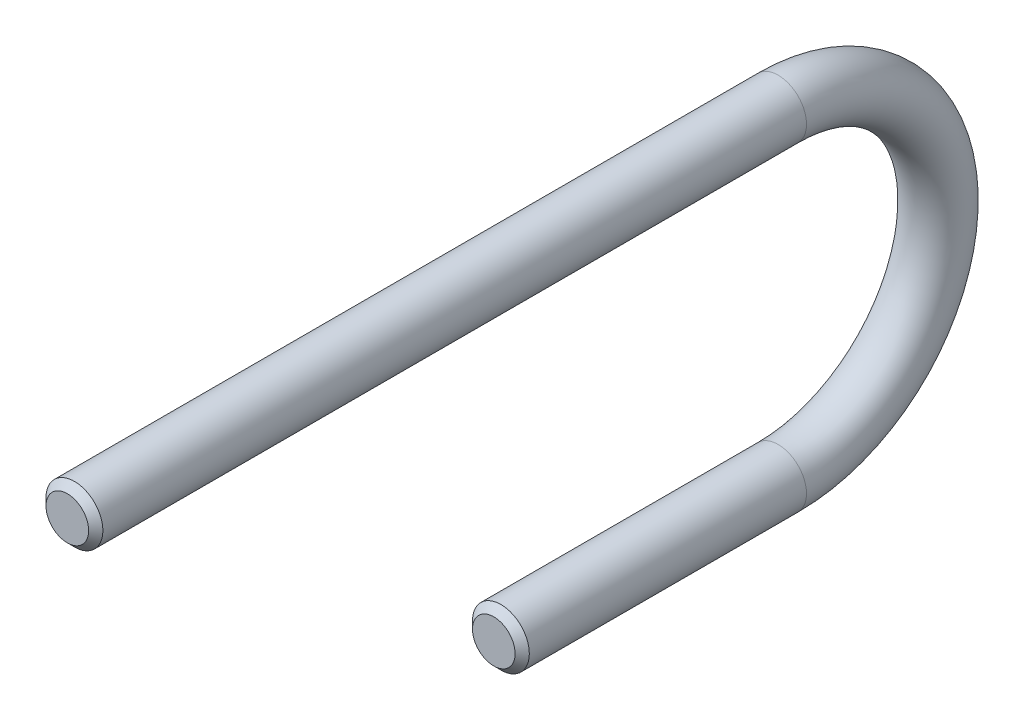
from build123d import *

# Parameters (mm, degrees)
SKETCH2_R     = 4
CHAMFER1_SIZE = 1


with BuildPart() as part:
    # Sweep1: sweep along a path in Sketch1
    with BuildLine(Plane(origin=(0, 0, 0), x_dir=(0, 0, -1), z_dir=(1, 0, 0))) as sweep1_path:
        Line((0, 0), (40, 0))
        ThreePointArc((40, 0), (62.5, 22.5), (40, 45))
        Line((40, 45), (-60, 45))
    # Sketch2 → Sweep1 (sweep)
    with BuildSketch(Plane.XY):
        Circle(SKETCH2_R)
    sweep(path=sweep1_path.line)

    # Chamfer1
    chamfer1_edges = [part.edges().sort_by_distance(p)[0] for p in [
        (-4, 45, 60),
        (-4, 0, 0),
    ]]
    chamfer(chamfer1_edges, length=CHAMFER1_SIZE)


solid = part.part
